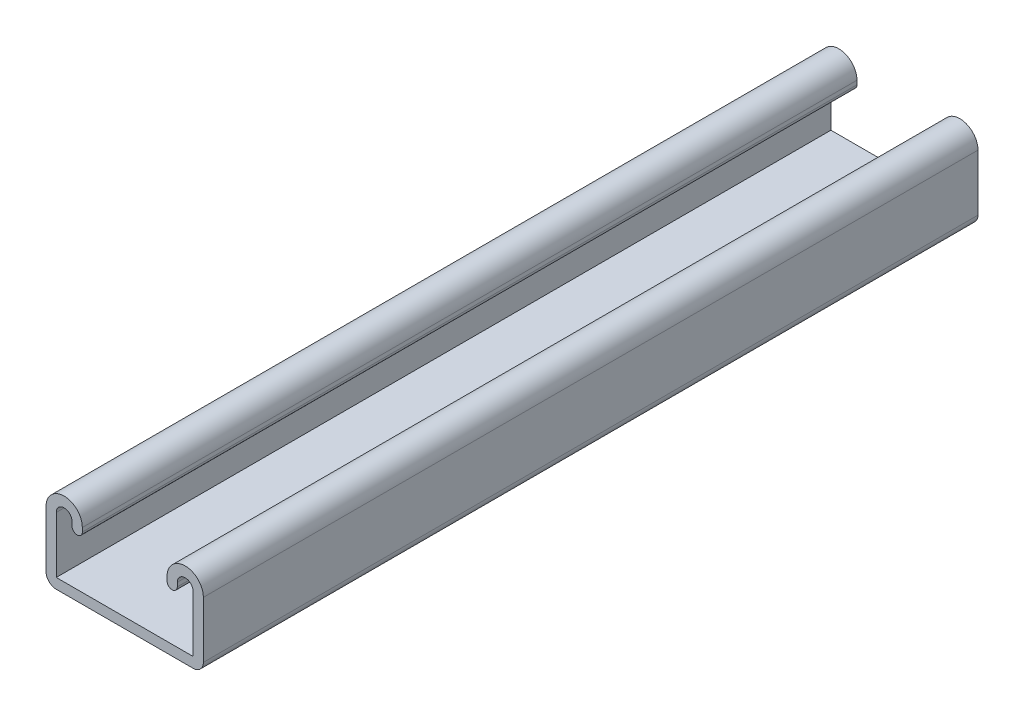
from build123d import *

# Parameters (mm, degrees)
BASE_EXTRUDE_DEPTH = 203.2
SLOT_DEPTH         = 223.005691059
LPATTERN1_COUNT    = 2
LPATTERN1_PITCH    = 101.6


with BuildPart() as part:
    # Sketch1 → Base-Extrude (new body)
    with BuildSketch(Plane.XY):
        with BuildLine():
            Line((-20.6375, 8.3693), (-20.6375, -6.4008))
            ThreePointArc((-20.6375, -6.4008), (-19.848914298, -8.304614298), (-17.9451, -9.0932))
            Line((-17.9451, -9.0932), (17.9451, -9.0932))
            ThreePointArc((17.9451, -9.0932), (19.848914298, -8.304614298), (20.6375, -6.4008))
            Line((20.6375, -6.4008), (20.6375, 8.3693))
            ThreePointArc((20.6375, 8.3693), (15.875, 13.1318), (11.1125, 8.3693))
            Line((11.1125, 8.3693), (11.1125, 7.33425))
            ThreePointArc((11.1125, 7.33425), (12.4587, 5.98805), (13.8049, 7.33425))
            Line((13.8049, 7.33425), (13.8049, 8.3693))
            ThreePointArc((13.8049, 8.3693), (15.875, 10.4394), (17.9451, 8.3693))
            Line((17.9451, 8.3693), (17.9451, -6.4008))
            Line((17.9451, -6.4008), (-17.9451, -6.4008))
            Line((-17.9451, -6.4008), (-17.9451, 8.3693))
            ThreePointArc((-17.9451, 8.3693), (-15.875, 10.4394), (-13.8049, 8.3693))
            Line((-13.8049, 8.3693), (-13.8049, 7.33425))
            ThreePointArc((-13.8049, 7.33425), (-12.4587, 5.98805), (-11.1125, 7.33425))
            Line((-11.1125, 7.33425), (-11.1125, 8.3693))
            ThreePointArc((-11.1125, 8.3693), (-15.875, 13.1318), (-20.6375, 8.3693))
        make_face()
    extrude(amount=BASE_EXTRUDE_DEPTH)

    # Sketch2 → Slot (cut, through all)
    with BuildSketch(Plane(origin=(0, -9.0932, -16.724236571), x_dir=(1, 0, 0), z_dir=(0, -1, 0))):
        with BuildLine():
            Line((5.159375, 95.305486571), (5.159375, 29.424236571))
            ThreePointArc((5.159375, 29.424236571), (0, 24.264861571), (-5.159375, 29.424236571))
            Line((-5.159375, 29.424236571), (-5.159375, 95.305486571))
            ThreePointArc((-5.159375, 95.305486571), (0, 100.464861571), (5.159375, 95.305486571))
        make_face()
    slot = extrude(amount=-SLOT_DEPTH, mode=Mode.SUBTRACT)

    # LPattern1: Slot ×2
    with Locations(*[(0, 0, i * LPATTERN1_PITCH) for i in range(1, LPATTERN1_COUNT)]):
        add(slot, mode=Mode.SUBTRACT)


solid = part.part
